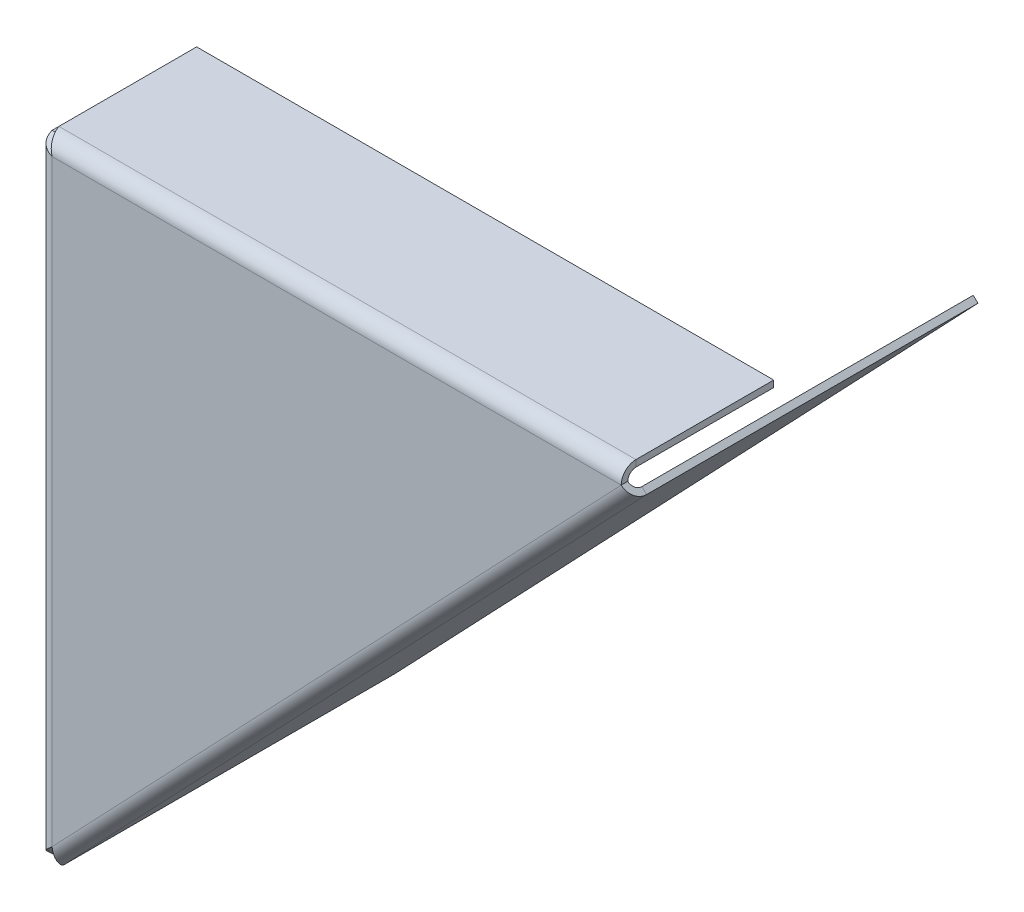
ISO-10303-21;
HEADER;
FILE_DESCRIPTION(('STEP AP214'),'2;1');
FILE_NAME('part.step','',(''),(''),'','','');
FILE_SCHEMA(('AUTOMOTIVE_DESIGN { 1 0 10303 214 1 1 1 1 }'));
ENDSEC;
DATA;
#1=APPLICATION_CONTEXT('core data for automotive mechanical design processes');
#2=APPLICATION_PROTOCOL_DEFINITION('international standard','automotive_design',2000,#1);
#3=PRODUCT_CONTEXT('',#1,'mechanical');
#4=PRODUCT('Part','Part','',(#3));
#5=PRODUCT_RELATED_PRODUCT_CATEGORY('part','',(#4));
#6=PRODUCT_DEFINITION_FORMATION('','',#4);
#7=PRODUCT_DEFINITION_CONTEXT('part definition',#1,'design');
#8=PRODUCT_DEFINITION('design','',#6,#7);
#9=PRODUCT_DEFINITION_SHAPE('','',#8);
#10=(LENGTH_UNIT() NAMED_UNIT(*) SI_UNIT(.MILLI.,.METRE.));
#11=(NAMED_UNIT(*) PLANE_ANGLE_UNIT() SI_UNIT($,.RADIAN.));
#12=(NAMED_UNIT(*) SI_UNIT($,.STERADIAN.) SOLID_ANGLE_UNIT());
#13=UNCERTAINTY_MEASURE_WITH_UNIT(LENGTH_MEASURE(1.E-05),#10,'distance_accuracy_value','');
#14=(GEOMETRIC_REPRESENTATION_CONTEXT(3) GLOBAL_UNCERTAINTY_ASSIGNED_CONTEXT((#13)) GLOBAL_UNIT_ASSIGNED_CONTEXT((#10,
#11,#12)) REPRESENTATION_CONTEXT('',''));
#15=CARTESIAN_POINT('',(0.,0.,0.));
#16=DIRECTION('',(0.,0.,1.));
#17=DIRECTION('',(1.,0.,0.));
#18=AXIS2_PLACEMENT_3D('',#15,#16,#17);
#19=CARTESIAN_POINT('',(0.,0.,1.99999999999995));
#20=DIRECTION('',(0.,0.,1.));
#21=DIRECTION('',(1.,0.,0.));
#22=AXIS2_PLACEMENT_3D('',#19,#20,#21);
#23=PLANE('',#22);
#24=DIRECTION('',(0.,-1.,0.));
#25=VECTOR('',#24,1.);
#26=CARTESIAN_POINT('',(0.,0.,1.99999999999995));
#27=LINE('',#26,#25);
#28=CARTESIAN_POINT('',(0.,0.,1.99999999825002));
#29=VERTEX_POINT('',#28);
#30=CARTESIAN_POINT('',(0.,-182.191293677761,2.00000008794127));
#31=VERTEX_POINT('',#30);
#32=EDGE_CURVE('E223',#29,#31,#27,.T.);
#33=ORIENTED_EDGE('',*,*,#32,.T.);
#34=DIRECTION('',(0.6895592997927,0.724229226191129,0.));
#35=VECTOR('',#34,1.);
#36=CARTESIAN_POINT('',(0.,-182.191293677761,1.99999999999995));
#37=LINE('',#36,#35);
#38=CARTESIAN_POINT('',(173.469526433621,0.,2.00000004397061));
#39=VERTEX_POINT('',#38);
#40=EDGE_CURVE('E487',#31,#39,#37,.T.);
#41=ORIENTED_EDGE('',*,*,#40,.T.);
#42=DIRECTION('',(-1.,0.,0.));
#43=VECTOR('',#42,1.);
#44=CARTESIAN_POINT('',(0.,0.,1.99999999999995));
#45=LINE('',#44,#43);
#46=EDGE_CURVE('E488',#39,#29,#45,.T.);
#47=ORIENTED_EDGE('',*,*,#46,.T.);
#48=EDGE_LOOP('',(#33,#41,#47));
#49=FACE_BOUND('',#48,.T.);
#50=ADVANCED_FACE('F121',(#49),#23,.T.);
#51=CARTESIAN_POINT('',(0.,0.,0.));
#52=DIRECTION('',(0.,0.,1.));
#53=DIRECTION('',(1.,0.,0.));
#54=AXIS2_PLACEMENT_3D('',#51,#52,#53);
#55=PLANE('',#54);
#56=DIRECTION('',(0.,-1.,0.));
#57=VECTOR('',#56,1.);
#58=CARTESIAN_POINT('',(0.,0.,0.));
#59=LINE('',#58,#57);
#60=CARTESIAN_POINT('',(0.,0.,-1.74998253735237E-09));
#61=VERTEX_POINT('',#60);
#62=CARTESIAN_POINT('',(0.,-182.191293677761,8.79412714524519E-08));
#63=VERTEX_POINT('',#62);
#64=EDGE_CURVE('E489',#61,#63,#59,.T.);
#65=ORIENTED_EDGE('',*,*,#64,.F.);
#66=DIRECTION('',(-1.,0.,0.));
#67=VECTOR('',#66,1.);
#68=CARTESIAN_POINT('',(0.,0.,0.));
#69=LINE('',#68,#67);
#70=CARTESIAN_POINT('',(173.469526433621,0.,0.));
#71=VERTEX_POINT('',#70);
#72=EDGE_CURVE('E526',#71,#61,#69,.T.);
#73=ORIENTED_EDGE('',*,*,#72,.F.);
#74=DIRECTION('',(0.6895592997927,0.724229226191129,0.));
#75=VECTOR('',#74,1.);
#76=CARTESIAN_POINT('',(0.,-182.191293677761,0.));
#77=LINE('',#76,#75);
#78=EDGE_CURVE('E130',#63,#71,#77,.T.);
#79=ORIENTED_EDGE('',*,*,#78,.F.);
#80=EDGE_LOOP('',(#65,#73,#79));
#81=FACE_BOUND('',#80,.T.);
#82=ADVANCED_FACE('F123',(#81),#55,.F.);
#83=CARTESIAN_POINT('',(0.,0.,2.01999999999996));
#84=CARTESIAN_POINT('',(-0.202473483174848,0.591762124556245,2.01999999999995));
#85=CARTESIAN_POINT('',(-0.404881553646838,1.18310043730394,1.90235649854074));
#86=CARTESIAN_POINT('',(-0.809763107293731,2.27635779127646,1.4495144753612));
#87=CARTESIAN_POINT('',(-1.01220388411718,2.77775117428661,1.11449412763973));
#88=CARTESIAN_POINT('',(-1.41708543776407,3.61449412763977,0.277751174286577));
#89=CARTESIAN_POINT('',(-1.61952621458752,3.94951447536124,-0.223642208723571));
#90=CARTESIAN_POINT('',(-2.02440776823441,4.40235649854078,-1.31689956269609));
#91=CARTESIAN_POINT('',(-2.2268158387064,4.52,-1.90823787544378));
#92=CARTESIAN_POINT('',(-2.4292893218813,4.52,-2.50000000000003));
#93=CARTESIAN_POINT('',(0.,0.,1.99999999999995));
#94=CARTESIAN_POINT('',(-0.202473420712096,0.589143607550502,1.99999999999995));
#95=CARTESIAN_POINT('',(-0.404881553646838,1.17786547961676,1.88287704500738));
#96=CARTESIAN_POINT('',(-0.809763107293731,2.26628541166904,1.43203874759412));
#97=CARTESIAN_POINT('',(-1.01220388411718,2.76546023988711,1.09850079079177));
#98=CARTESIAN_POINT('',(-1.41708543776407,3.5985007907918,0.265460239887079));
#99=CARTESIAN_POINT('',(-1.61952621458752,3.93203874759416,-0.233714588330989));
#100=CARTESIAN_POINT('',(-2.02440776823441,4.38287704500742,-1.32213452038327));
#101=CARTESIAN_POINT('',(-2.22681590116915,4.5,-1.91085639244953));
#102=CARTESIAN_POINT('',(-2.4292893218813,4.5,-2.50000000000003));
#103=CARTESIAN_POINT('',(0.,0.,0.));
#104=CARTESIAN_POINT('',(-0.202467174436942,0.327291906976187,0.));
#105=CARTESIAN_POINT('',(-0.404881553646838,0.654369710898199,-0.0650683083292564));
#106=CARTESIAN_POINT('',(-0.809763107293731,1.25904745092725,-0.315534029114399));
#107=CARTESIAN_POINT('',(-1.01220388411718,1.53636679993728,-0.500832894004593));
#108=CARTESIAN_POINT('',(-1.41708543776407,1.99916710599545,-0.963633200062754));
#109=CARTESIAN_POINT('',(-1.61952621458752,2.18446597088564,-1.24095254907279));
#110=CARTESIAN_POINT('',(-2.02440776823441,2.43493169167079,-1.84563028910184));
#111=CARTESIAN_POINT('',(-2.22682214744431,2.5,-2.17270809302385));
#112=CARTESIAN_POINT('',(-2.4292893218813,2.5,-2.50000000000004));
#113=CARTESIAN_POINT('',(0.,0.,-0.0202000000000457));
#114=CARTESIAN_POINT('',(-0.202467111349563,0.324647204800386,-0.0202000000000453));
#115=CARTESIAN_POINT('',(-0.404881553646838,0.649082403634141,-0.084742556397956));
#116=CARTESIAN_POINT('',(-0.809763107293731,1.24887434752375,-0.333184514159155));
#117=CARTESIAN_POINT('',(-1.01220388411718,1.52395295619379,-0.516986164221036));
#118=CARTESIAN_POINT('',(-1.41708543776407,1.983013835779,-0.976047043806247));
#119=CARTESIAN_POINT('',(-1.61952621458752,2.16681548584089,-1.25112565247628));
#120=CARTESIAN_POINT('',(-2.02440776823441,2.41525744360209,-1.8509175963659));
#121=CARTESIAN_POINT('',(-2.22682221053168,2.4798,-2.17535279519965));
#122=CARTESIAN_POINT('',(-2.4292893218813,2.4798,-2.50000000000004));
#123=B_SPLINE_SURFACE_WITH_KNOTS('',1,3,((#83,#84,#85,#86,#87,#88,#89,#90,#91,#92),(#93,#94,#95,
#96,#97,#98,#99,#100,#101,#102),(#103,#104,#105,#106,#107,#108,#109,#110,#111,#112),(#113,#114,
#115,#116,#117,#118,#119,#120,#121,#122)),.UNSPECIFIED.,.F.,.F.,.F.,(2,1,1,2),(4,2,2,2,4),
(-0.01,0.,1.,1.0101),(0.,0.25,0.5,0.75,1.),.UNSPECIFIED.);
#124=DIRECTION('',(0.,-1.,0.));
#125=VECTOR('',#124,1.);
#126=CARTESIAN_POINT('',(-2.42928932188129,4.5,-2.50000000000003));
#127=LINE('',#126,#125);
#128=CARTESIAN_POINT('',(-2.4292893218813,2.5,-2.50000000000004));
#129=VERTEX_POINT('',#128);
#130=CARTESIAN_POINT('',(-2.4292893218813,4.5,-2.50000000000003));
#131=VERTEX_POINT('',#130);
#132=EDGE_CURVE('E158',#129,#131,#127,.F.);
#133=CARTESIAN_POINT('',(0.,0.,0.));
#134=CARTESIAN_POINT('',(-0.0453245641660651,0.0732648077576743,8.72828186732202E-06));
#135=CARTESIAN_POINT('',(-0.0906481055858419,0.146528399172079,-0.00322033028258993));
#136=CARTESIAN_POINT('',(-0.181287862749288,0.292481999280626,-0.0160899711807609));
#137=CARTESIAN_POINT('',(-0.22660407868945,0.365172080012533,-0.0257297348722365));
#138=CARTESIAN_POINT('',(-0.317254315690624,0.509456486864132,-0.0513620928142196));
#139=CARTESIAN_POINT('',(-0.362588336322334,0.581050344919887,-0.0673573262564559));
#140=CARTESIAN_POINT('',(-0.453261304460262,0.722557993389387,-0.105572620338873));
#141=CARTESIAN_POINT('',(-0.498600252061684,0.792471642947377,-0.127793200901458));
#142=CARTESIAN_POINT('',(-0.595116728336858,0.938935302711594,-0.181543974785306));
#143=CARTESIAN_POINT('',(-0.64629530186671,1.01518255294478,-0.213903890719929));
#144=CARTESIAN_POINT('',(-0.748657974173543,1.16410927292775,-0.286019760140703));
#145=CARTESIAN_POINT('',(-0.799842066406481,1.23678724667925,-0.325778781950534));
#146=CARTESIAN_POINT('',(-0.953316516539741,1.44824985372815,-0.455532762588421));
#147=CARTESIAN_POINT('',(-1.055677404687,1.58069258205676,-0.556089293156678));
#148=CARTESIAN_POINT('',(-1.26042206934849,1.82312463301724,-0.781394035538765));
#149=CARTESIAN_POINT('',(-1.36280584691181,1.93311037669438,-0.906146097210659));
#150=CARTESIAN_POINT('',(-1.51631405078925,2.07800929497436,-1.10760577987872));
#151=CARTESIAN_POINT('',(-1.56751447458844,2.12299115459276,-1.17721104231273));
#152=CARTESIAN_POINT('',(-1.66991342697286,2.20582859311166,-1.32052606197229));
#153=CARTESIAN_POINT('',(-1.72111194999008,2.24368665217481,-1.39423437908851));
#154=CARTESIAN_POINT('',(-1.82701863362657,2.31424378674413,-1.55021154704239));
#155=CARTESIAN_POINT('',(-1.88172681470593,2.34641137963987,-1.63272086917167));
#156=CARTESIAN_POINT('',(-1.9911458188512,2.40183057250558,-1.80069100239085));
#157=CARTESIAN_POINT('',(-2.04585664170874,2.42508136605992,-1.88615207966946));
#158=CARTESIAN_POINT('',(-2.15535214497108,2.46241975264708,-2.0591760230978));
#159=CARTESIAN_POINT('',(-2.21013682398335,2.47649476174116,-2.1467416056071));
#160=CARTESIAN_POINT('',(-2.31970982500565,2.49529456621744,-2.32287091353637));
#161=CARTESIAN_POINT('',(-2.37449814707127,2.50001913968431,-2.41143466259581));
#162=CARTESIAN_POINT('',(-2.4292893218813,2.5,-2.50000000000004));
#163=B_SPLINE_CURVE_WITH_KNOTS('',3,(#133,#134,#135,#136,#137,#138,#139,#140,#141,#142,#143,
#144,#145,#146,#147,#148,#149,#150,#151,#152,#153,#154,#155,#156,#157,#158,#159,#160,#161,#162),
.UNSPECIFIED.,.F.,.F.,(4,2,2,2,2,2,2,2,2,2,2,2,2,2,4),(0.,0.258390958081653,0.516748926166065,
0.775214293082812,1.03370125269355,1.32542887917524,1.61727775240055,2.20012840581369,
2.78307187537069,3.07502634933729,3.36687899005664,3.67873630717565,3.99062182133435,
4.30293416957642,4.61525392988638),.UNSPECIFIED.);
#164=EDGE_CURVE('E483',#61,#129,#163,.T.);
#165=CARTESIAN_POINT('',(0.,0.,1.99999999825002));
#166=CARTESIAN_POINT('',(0.,0.,-1.74998253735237E-09));
#167=B_SPLINE_CURVE_WITH_KNOTS('',1,(#165,#166),.UNSPECIFIED.,.F.,.F.,(2,2),(0.,1.),.UNSPECIFIED.);
#168=EDGE_CURVE('E491',#29,#61,#167,.T.);
#169=CARTESIAN_POINT('',(0.,0.,1.99999999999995));
#170=CARTESIAN_POINT('',(-0.0460035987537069,0.133852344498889,2.0000170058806));
#171=CARTESIAN_POINT('',(-0.0920061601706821,0.267702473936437,1.99402856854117));
#172=CARTESIAN_POINT('',(-0.184006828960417,0.534332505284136,1.97016352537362));
#173=CARTESIAN_POINT('',(-0.230004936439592,0.667112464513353,1.9522875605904));
#174=CARTESIAN_POINT('',(-0.321962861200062,0.930446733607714,1.9047889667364));
#175=CARTESIAN_POINT('',(-0.367922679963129,1.0610027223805,1.8751756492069));
#176=CARTESIAN_POINT('',(-0.459845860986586,1.31895643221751,1.80444383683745));
#177=CARTESIAN_POINT('',(-0.505809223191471,1.44635419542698,1.76332549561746));
#178=CARTESIAN_POINT('',(-0.59776379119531,1.69706000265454,1.66987954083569));
#179=CARTESIAN_POINT('',(-0.643754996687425,1.82036547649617,1.61754503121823));
#180=CARTESIAN_POINT('',(-0.735754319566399,2.06186789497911,1.50207713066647));
#181=CARTESIAN_POINT('',(-0.781762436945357,2.18006294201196,1.43893977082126));
#182=CARTESIAN_POINT('',(-0.873746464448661,2.41028578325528,1.30242306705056));
#183=CARTESIAN_POINT('',(-0.919722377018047,2.52231731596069,1.22905002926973));
#184=CARTESIAN_POINT('',(-1.01169322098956,2.7394364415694,1.07259001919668));
#185=CARTESIAN_POINT('',(-1.05768815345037,2.84452160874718,0.989499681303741));
#186=CARTESIAN_POINT('',(-1.14966782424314,3.04684511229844,0.814307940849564));
#187=CARTESIAN_POINT('',(-1.19565256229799,3.14408537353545,0.722208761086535));
#188=CARTESIAN_POINT('',(-1.28762275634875,3.32997485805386,0.52971447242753));
#189=CARTESIAN_POINT('',(-1.33360821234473,3.41862408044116,0.429319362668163));
#190=CARTESIAN_POINT('',(-1.42560187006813,3.58667601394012,0.220970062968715));
#191=CARTESIAN_POINT('',(-1.47161006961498,3.66607336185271,0.113011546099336));
#192=CARTESIAN_POINT('',(-1.56361041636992,3.81490337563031,-0.109514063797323));
#193=CARTESIAN_POINT('',(-1.60960256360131,3.88433949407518,-0.224078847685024));
#194=CARTESIAN_POINT('',(-1.7016276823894,4.01277864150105,-0.459032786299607));
#195=CARTESIAN_POINT('',(-1.7476606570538,4.07177324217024,-0.579426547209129));
#196=CARTESIAN_POINT('',(-1.83970886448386,4.17877180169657,-0.824950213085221));
#197=CARTESIAN_POINT('',(-1.885724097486,4.22677983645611,-0.950078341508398));
#198=CARTESIAN_POINT('',(-1.97771164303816,4.31141286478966,-1.20400082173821));
#199=CARTESIAN_POINT('',(-2.02368395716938,4.34804800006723,-1.33279179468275));
#200=CARTESIAN_POINT('',(-2.11560853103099,4.40969031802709,-1.59307716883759));
#201=CARTESIAN_POINT('',(-2.16156079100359,4.43470242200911,-1.72457040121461));
#202=CARTESIAN_POINT('',(-2.24450645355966,4.46919477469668,-1.96344889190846));
#203=CARTESIAN_POINT('',(-2.28150074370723,4.48075184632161,-2.07053895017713));
#204=CARTESIAN_POINT('',(-2.3554256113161,4.49615061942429,-2.28508374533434));
#205=CARTESIAN_POINT('',(-2.39235618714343,4.50000576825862,-2.39253751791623));
#206=CARTESIAN_POINT('',(-2.4292893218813,4.5,-2.50000000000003));
#207=B_SPLINE_CURVE_WITH_KNOTS('',3,(#169,#170,#171,#172,#173,#174,#175,#176,#177,#178,#179,
#180,#181,#182,#183,#184,#185,#186,#187,#188,#189,#190,#191,#192,#193,#194,#195,#196,#197,#198,
#199,#200,#201,#202,#203,#204,#205,#206),.UNSPECIFIED.,.F.,.F.,(4,2,2,2,2,2,2,2,2,2,2,2,2,2,2,2,
2,2,4),(0.,0.424481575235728,0.84894026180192,1.27306288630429,1.69717984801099,
2.12155832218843,2.54609304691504,2.97036736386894,3.39478906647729,3.81910631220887,
4.24342360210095,4.66798565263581,5.09240019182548,5.51715576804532,5.94175350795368,
6.36597152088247,6.79000975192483,7.13141947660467,7.47223258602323),.UNSPECIFIED.);
#208=EDGE_CURVE('E482',#29,#131,#207,.T.);
#209=ORIENTED_EDGE('',*,*,#132,.F.);
#210=ORIENTED_EDGE('',*,*,#164,.F.);
#211=ORIENTED_EDGE('',*,*,#168,.F.);
#212=ORIENTED_EDGE('',*,*,#208,.T.);
#213=EDGE_LOOP('',(#209,#210,#211,#212));
#214=FACE_BOUND('',#213,.T.);
#215=ADVANCED_FACE('F535',(#214),#123,.F.);
#216=CARTESIAN_POINT('',(173.469526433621,0.,-2.50000000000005));
#217=DIRECTION('',(-1.,0.,0.));
#218=DIRECTION('',(0.,0.,1.));
#219=AXIS2_PLACEMENT_3D('',#216,#217,#218);
#220=PLANE('',#219);
#221=CARTESIAN_POINT('',(173.469526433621,0.,-2.50000000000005));
#222=DIRECTION('',(1.,0.,0.));
#223=DIRECTION('',(0.,0.,-1.));
#224=AXIS2_PLACEMENT_3D('',#221,#222,#223);
#225=CIRCLE('',#224,2.5);
#226=CARTESIAN_POINT('',(173.469526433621,2.5,-2.50000000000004));
#227=VERTEX_POINT('',#226);
#228=EDGE_CURVE('E477',#227,#71,#225,.T.);
#229=ORIENTED_EDGE('',*,*,#228,.F.);
#230=DIRECTION('',(0.,-1.,0.));
#231=VECTOR('',#230,1.);
#232=CARTESIAN_POINT('',(173.469526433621,2.5,-2.50000000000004));
#233=LINE('',#232,#231);
#234=CARTESIAN_POINT('',(173.469526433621,4.5,-2.50000000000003));
#235=VERTEX_POINT('',#234);
#236=EDGE_CURVE('E481',#227,#235,#233,.F.);
#237=ORIENTED_EDGE('',*,*,#236,.T.);
#238=CARTESIAN_POINT('',(173.469526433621,0.,-2.50000000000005));
#239=DIRECTION('',(1.,0.,0.));
#240=DIRECTION('',(0.,0.,-1.));
#241=AXIS2_PLACEMENT_3D('',#238,#239,#240);
#242=CIRCLE('',#241,4.5);
#243=EDGE_CURVE('E479',#235,#39,#242,.T.);
#244=ORIENTED_EDGE('',*,*,#243,.T.);
#245=DIRECTION('',(0.,0.,-1.));
#246=VECTOR('',#245,1.);
#247=CARTESIAN_POINT('',(173.469526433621,0.,1.99999999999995));
#248=LINE('',#247,#246);
#249=EDGE_CURVE('E13',#39,#71,#248,.T.);
#250=ORIENTED_EDGE('',*,*,#249,.T.);
#251=EDGE_LOOP('',(#229,#237,#244,#250));
#252=FACE_BOUND('',#251,.T.);
#253=ADVANCED_FACE('F474',(#252),#220,.F.);
#254=CARTESIAN_POINT('',(173.469526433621,0.,-2.50000000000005));
#255=DIRECTION('',(1.,0.,0.));
#256=DIRECTION('',(0.,1.,0.));
#257=AXIS2_PLACEMENT_3D('',#254,#255,#256);
#258=CYLINDRICAL_SURFACE('',#257,4.5);
#259=ORIENTED_EDGE('',*,*,#46,.F.);
#260=ORIENTED_EDGE('',*,*,#243,.F.);
#261=DIRECTION('',(1.,0.,0.));
#262=VECTOR('',#261,1.);
#263=CARTESIAN_POINT('',(0.,4.5,-2.50000000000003));
#264=LINE('',#263,#262);
#265=EDGE_CURVE('E147',#235,#131,#264,.F.);
#266=ORIENTED_EDGE('',*,*,#265,.T.);
#267=ORIENTED_EDGE('',*,*,#208,.F.);
#268=EDGE_LOOP('',(#259,#260,#266,#267));
#269=FACE_BOUND('',#268,.T.);
#270=ADVANCED_FACE('F539',(#269),#258,.T.);
#271=CARTESIAN_POINT('',(173.469526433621,0.,-2.50000000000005));
#272=DIRECTION('',(1.,0.,0.));
#273=DIRECTION('',(0.,1.,0.));
#274=AXIS2_PLACEMENT_3D('',#271,#272,#273);
#275=CYLINDRICAL_SURFACE('',#274,2.5);
#276=ORIENTED_EDGE('',*,*,#72,.T.);
#277=ORIENTED_EDGE('',*,*,#164,.T.);
#278=DIRECTION('',(1.,0.,0.));
#279=VECTOR('',#278,1.);
#280=CARTESIAN_POINT('',(0.,2.5,-2.50000000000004));
#281=LINE('',#280,#279);
#282=EDGE_CURVE('E596',#129,#227,#281,.T.);
#283=ORIENTED_EDGE('',*,*,#282,.T.);
#284=ORIENTED_EDGE('',*,*,#228,.T.);
#285=EDGE_LOOP('',(#276,#277,#283,#284));
#286=FACE_BOUND('',#285,.T.);
#287=ADVANCED_FACE('F540',(#286),#275,.F.);
#288=CARTESIAN_POINT('',(173.469526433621,4.50000000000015,-44.4862846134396));
#289=DIRECTION('',(-1.,0.,0.));
#290=DIRECTION('',(0.,0.,1.));
#291=AXIS2_PLACEMENT_3D('',#288,#289,#290);
#292=PLANE('',#291);
#293=ORIENTED_EDGE('',*,*,#236,.F.);
#294=DIRECTION('',(0.,0.,1.));
#295=VECTOR('',#294,1.);
#296=CARTESIAN_POINT('',(173.469526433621,2.50000000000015,-44.4862846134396));
#297=LINE('',#296,#295);
#298=CARTESIAN_POINT('',(173.469526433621,2.50000000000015,-44.4862846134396));
#299=VERTEX_POINT('',#298);
#300=EDGE_CURVE('E600',#227,#299,#297,.F.);
#301=ORIENTED_EDGE('',*,*,#300,.T.);
#302=DIRECTION('',(0.,-1.,0.));
#303=VECTOR('',#302,1.);
#304=CARTESIAN_POINT('',(173.469526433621,4.50000000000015,-44.4862846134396));
#305=LINE('',#304,#303);
#306=CARTESIAN_POINT('',(173.469526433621,4.50000000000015,-44.4862846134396));
#307=VERTEX_POINT('',#306);
#308=EDGE_CURVE('E606',#307,#299,#305,.T.);
#309=ORIENTED_EDGE('',*,*,#308,.F.);
#310=DIRECTION('',(0.,0.,-1.));
#311=VECTOR('',#310,1.);
#312=CARTESIAN_POINT('',(173.469526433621,4.49999999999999,0.));
#313=LINE('',#312,#311);
#314=EDGE_CURVE('E166',#235,#307,#313,.T.);
#315=ORIENTED_EDGE('',*,*,#314,.F.);
#316=EDGE_LOOP('',(#293,#301,#309,#315));
#317=FACE_BOUND('',#316,.T.);
#318=ADVANCED_FACE('F636',(#317),#292,.F.);
#319=CARTESIAN_POINT('',(173.469526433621,4.49999999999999,0.));
#320=DIRECTION('',(0.,-1.,0.));
#321=DIRECTION('',(0.,0.,-1.));
#322=AXIS2_PLACEMENT_3D('',#319,#320,#321);
#323=PLANE('',#322);
#324=ORIENTED_EDGE('',*,*,#265,.F.);
#325=ORIENTED_EDGE('',*,*,#314,.T.);
#326=DIRECTION('',(-1.,0.,0.));
#327=VECTOR('',#326,1.);
#328=CARTESIAN_POINT('',(173.469526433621,4.50000000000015,-44.4862846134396));
#329=LINE('',#328,#327);
#330=CARTESIAN_POINT('',(-2.42928932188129,4.50000000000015,-44.4862846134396));
#331=VERTEX_POINT('',#330);
#332=EDGE_CURVE('E181',#307,#331,#329,.T.);
#333=ORIENTED_EDGE('',*,*,#332,.T.);
#334=DIRECTION('',(0.,0.,1.));
#335=VECTOR('',#334,1.);
#336=CARTESIAN_POINT('',(-2.42928932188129,4.49999999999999,0.));
#337=LINE('',#336,#335);
#338=EDGE_CURVE('E584',#331,#131,#337,.T.);
#339=ORIENTED_EDGE('',*,*,#338,.T.);
#340=EDGE_LOOP('',(#324,#325,#333,#339));
#341=FACE_BOUND('',#340,.T.);
#342=ADVANCED_FACE('F590',(#341),#323,.F.);
#343=CARTESIAN_POINT('',(173.469526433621,2.49999999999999,0.));
#344=DIRECTION('',(0.,-1.,0.));
#345=DIRECTION('',(0.,0.,-1.));
#346=AXIS2_PLACEMENT_3D('',#343,#344,#345);
#347=PLANE('',#346);
#348=ORIENTED_EDGE('',*,*,#300,.F.);
#349=ORIENTED_EDGE('',*,*,#282,.F.);
#350=DIRECTION('',(0.,0.,-1.));
#351=VECTOR('',#350,1.);
#352=CARTESIAN_POINT('',(-2.42928932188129,2.49999999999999,0.));
#353=LINE('',#352,#351);
#354=CARTESIAN_POINT('',(-2.42928932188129,2.50000000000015,-44.4862846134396));
#355=VERTEX_POINT('',#354);
#356=EDGE_CURVE('E587',#355,#129,#353,.F.);
#357=ORIENTED_EDGE('',*,*,#356,.F.);
#358=DIRECTION('',(1.,0.,0.));
#359=VECTOR('',#358,1.);
#360=CARTESIAN_POINT('',(0.,2.50000000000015,-44.4862846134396));
#361=LINE('',#360,#359);
#362=EDGE_CURVE('E602',#299,#355,#361,.F.);
#363=ORIENTED_EDGE('',*,*,#362,.F.);
#364=EDGE_LOOP('',(#348,#349,#357,#363));
#365=FACE_BOUND('',#364,.T.);
#366=ADVANCED_FACE('F635',(#365),#347,.T.);
#367=CARTESIAN_POINT('',(0.,4.50000000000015,-44.4862846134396));
#368=DIRECTION('',(0.,0.,1.));
#369=DIRECTION('',(0.,-1.,0.));
#370=AXIS2_PLACEMENT_3D('',#367,#368,#369);
#371=PLANE('',#370);
#372=ORIENTED_EDGE('',*,*,#362,.T.);
#373=DIRECTION('',(0.,-1.,0.));
#374=VECTOR('',#373,1.);
#375=CARTESIAN_POINT('',(-2.42928932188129,4.50000000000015,-44.4862846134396));
#376=LINE('',#375,#374);
#377=EDGE_CURVE('E591',#331,#355,#376,.T.);
#378=ORIENTED_EDGE('',*,*,#377,.F.);
#379=ORIENTED_EDGE('',*,*,#332,.F.);
#380=ORIENTED_EDGE('',*,*,#308,.T.);
#381=EDGE_LOOP('',(#372,#378,#379,#380));
#382=FACE_BOUND('',#381,.T.);
#383=ADVANCED_FACE('F632',(#382),#371,.F.);
#384=CARTESIAN_POINT('',(-2.42928932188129,4.49999999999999,0.));
#385=DIRECTION('',(1.,0.,0.));
#386=DIRECTION('',(0.,0.,-1.));
#387=AXIS2_PLACEMENT_3D('',#384,#385,#386);
#388=PLANE('',#387);
#389=ORIENTED_EDGE('',*,*,#132,.T.);
#390=ORIENTED_EDGE('',*,*,#338,.F.);
#391=ORIENTED_EDGE('',*,*,#377,.T.);
#392=ORIENTED_EDGE('',*,*,#356,.T.);
#393=EDGE_LOOP('',(#389,#390,#391,#392));
#394=FACE_BOUND('',#393,.T.);
#395=ADVANCED_FACE('F582',(#394),#388,.F.);
#396=CARTESIAN_POINT('',(-4.50000000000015,-182.191293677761,-44.4862846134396));
#397=DIRECTION('',(0.,0.,1.));
#398=DIRECTION('',(1.,0.,0.));
#399=AXIS2_PLACEMENT_3D('',#396,#397,#398);
#400=PLANE('',#399);
#401=DIRECTION('',(0.,1.,0.));
#402=VECTOR('',#401,1.);
#403=CARTESIAN_POINT('',(-2.50000000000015,-182.191293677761,-44.4862846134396));
#404=LINE('',#403,#402);
#405=CARTESIAN_POINT('',(-2.50000000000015,2.42928932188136,-44.4862846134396));
#406=VERTEX_POINT('',#405);
#407=CARTESIAN_POINT('',(-2.50000000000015,-188.442493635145,-44.4862846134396));
#408=VERTEX_POINT('',#407);
#409=EDGE_CURVE('E190',#406,#408,#404,.F.);
#410=ORIENTED_EDGE('',*,*,#409,.T.);
#411=DIRECTION('',(1.,0.,0.));
#412=VECTOR('',#411,1.);
#413=CARTESIAN_POINT('',(-4.50000000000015,-188.442493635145,-44.4862846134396));
#414=LINE('',#413,#412);
#415=CARTESIAN_POINT('',(-4.50000000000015,-188.442493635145,-44.4862846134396));
#416=VERTEX_POINT('',#415);
#417=EDGE_CURVE('E588',#416,#408,#414,.T.);
#418=ORIENTED_EDGE('',*,*,#417,.F.);
#419=DIRECTION('',(0.,-1.,0.));
#420=VECTOR('',#419,1.);
#421=CARTESIAN_POINT('',(-4.50000000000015,0.,-44.4862846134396));
#422=LINE('',#421,#420);
#423=CARTESIAN_POINT('',(-4.50000000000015,2.42928932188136,-44.4862846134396));
#424=VERTEX_POINT('',#423);
#425=EDGE_CURVE('E726',#424,#416,#422,.T.);
#426=ORIENTED_EDGE('',*,*,#425,.F.);
#427=DIRECTION('',(1.,0.,0.));
#428=VECTOR('',#427,1.);
#429=CARTESIAN_POINT('',(-4.50000000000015,2.42928932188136,-44.4862846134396));
#430=LINE('',#429,#428);
#431=EDGE_CURVE('E714',#424,#406,#430,.T.);
#432=ORIENTED_EDGE('',*,*,#431,.T.);
#433=EDGE_LOOP('',(#410,#418,#426,#432));
#434=FACE_BOUND('',#433,.T.);
#435=ADVANCED_FACE('F631',(#434),#400,.F.);
#436=CARTESIAN_POINT('',(-4.49999999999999,0.,0.));
#437=DIRECTION('',(1.,0.,0.));
#438=DIRECTION('',(0.,0.,-1.));
#439=AXIS2_PLACEMENT_3D('',#436,#437,#438);
#440=PLANE('',#439);
#441=DIRECTION('',(0.,-1.,0.));
#442=VECTOR('',#441,1.);
#443=CARTESIAN_POINT('',(-4.5,-182.191293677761,-2.49999999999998));
#444=LINE('',#443,#442);
#445=CARTESIAN_POINT('',(-4.49999999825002,2.42928932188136,-2.49999999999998));
#446=VERTEX_POINT('',#445);
#447=CARTESIAN_POINT('',(-4.5,-188.442493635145,-2.49999999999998));
#448=VERTEX_POINT('',#447);
#449=EDGE_CURVE('E510',#446,#448,#444,.T.);
#450=ORIENTED_EDGE('',*,*,#449,.F.);
#451=DIRECTION('',(0.,0.,-1.));
#452=VECTOR('',#451,1.);
#453=CARTESIAN_POINT('',(-4.49999999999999,2.42928932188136,0.));
#454=LINE('',#453,#452);
#455=EDGE_CURVE('E730',#446,#424,#454,.T.);
#456=ORIENTED_EDGE('',*,*,#455,.T.);
#457=ORIENTED_EDGE('',*,*,#425,.T.);
#458=DIRECTION('',(0.,0.,-1.));
#459=VECTOR('',#458,1.);
#460=CARTESIAN_POINT('',(-4.5,-188.442493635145,-2.49999999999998));
#461=LINE('',#460,#459);
#462=EDGE_CURVE('E216',#448,#416,#461,.T.);
#463=ORIENTED_EDGE('',*,*,#462,.F.);
#464=EDGE_LOOP('',(#450,#456,#457,#463));
#465=FACE_BOUND('',#464,.T.);
#466=ADVANCED_FACE('F742',(#465),#440,.F.);
#467=CARTESIAN_POINT('',(-4.50000000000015,2.42928932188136,-44.4862846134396));
#468=DIRECTION('',(0.,-1.,0.));
#469=DIRECTION('',(0.,0.,-1.));
#470=AXIS2_PLACEMENT_3D('',#467,#468,#469);
#471=PLANE('',#470);
#472=CARTESIAN_POINT('',(-2.49999999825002,2.42928932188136,-2.49999999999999));
#473=CARTESIAN_POINT('',(-4.49999999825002,2.42928932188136,-2.49999999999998));
#474=B_SPLINE_CURVE_WITH_KNOTS('',1,(#472,#473),.UNSPECIFIED.,.F.,.F.,(2,2),(0.,1.),.UNSPECIFIED.);
#475=CARTESIAN_POINT('',(-2.5,2.42928932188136,-2.49999999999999));
#476=VERTEX_POINT('',#475);
#477=EDGE_CURVE('E710',#476,#446,#474,.T.);
#478=ORIENTED_EDGE('',*,*,#477,.F.);
#479=DIRECTION('',(0.,0.,1.));
#480=VECTOR('',#479,1.);
#481=CARTESIAN_POINT('',(-2.50000000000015,2.42928932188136,-44.4862846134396));
#482=LINE('',#481,#480);
#483=EDGE_CURVE('E724',#476,#406,#482,.F.);
#484=ORIENTED_EDGE('',*,*,#483,.T.);
#485=ORIENTED_EDGE('',*,*,#431,.F.);
#486=ORIENTED_EDGE('',*,*,#455,.F.);
#487=EDGE_LOOP('',(#478,#484,#485,#486));
#488=FACE_BOUND('',#487,.T.);
#489=ADVANCED_FACE('F741',(#488),#471,.F.);
#490=CARTESIAN_POINT('',(-2.49999999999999,0.,0.));
#491=DIRECTION('',(1.,0.,0.));
#492=DIRECTION('',(0.,0.,-1.));
#493=AXIS2_PLACEMENT_3D('',#490,#491,#492);
#494=PLANE('',#493);
#495=ORIENTED_EDGE('',*,*,#409,.F.);
#496=ORIENTED_EDGE('',*,*,#483,.F.);
#497=DIRECTION('',(0.,1.,0.));
#498=VECTOR('',#497,1.);
#499=CARTESIAN_POINT('',(-2.5,-182.191293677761,-2.49999999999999));
#500=LINE('',#499,#498);
#501=CARTESIAN_POINT('',(-2.5,-188.442493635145,-2.49999999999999));
#502=VERTEX_POINT('',#501);
#503=EDGE_CURVE('E713',#502,#476,#500,.T.);
#504=ORIENTED_EDGE('',*,*,#503,.F.);
#505=DIRECTION('',(0.,0.,-1.));
#506=VECTOR('',#505,1.);
#507=CARTESIAN_POINT('',(-2.5,-188.442493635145,-2.49999999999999));
#508=LINE('',#507,#506);
#509=EDGE_CURVE('E209',#502,#408,#508,.T.);
#510=ORIENTED_EDGE('',*,*,#509,.T.);
#511=EDGE_LOOP('',(#495,#496,#504,#510));
#512=FACE_BOUND('',#511,.T.);
#513=ADVANCED_FACE('F627',(#512),#494,.T.);
#514=CARTESIAN_POINT('',(-4.5,-188.442493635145,-2.49999999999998));
#515=DIRECTION('',(0.,-1.,0.));
#516=DIRECTION('',(0.,0.,-1.));
#517=AXIS2_PLACEMENT_3D('',#514,#515,#516);
#518=PLANE('',#517);
#519=ORIENTED_EDGE('',*,*,#509,.F.);
#520=CARTESIAN_POINT('',(-4.51999999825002,-188.442493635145,-2.49999999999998));
#521=CARTESIAN_POINT('',(-4.49999999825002,-188.442493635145,-2.49999999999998));
#522=CARTESIAN_POINT('',(-2.49999999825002,-188.442493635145,-2.49999999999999));
#523=CARTESIAN_POINT('',(-2.47979999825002,-188.442493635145,-2.49999999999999));
#524=B_SPLINE_CURVE_WITH_KNOTS('',1,(#520,#521,#522,#523),.UNSPECIFIED.,.F.,.F.,(2,1,1,2),
(-0.01,0.,1.,1.0101),.UNSPECIFIED.);
#525=EDGE_CURVE('E519',#448,#502,#524,.T.);
#526=ORIENTED_EDGE('',*,*,#525,.F.);
#527=ORIENTED_EDGE('',*,*,#462,.T.);
#528=ORIENTED_EDGE('',*,*,#417,.T.);
#529=EDGE_LOOP('',(#519,#526,#527,#528));
#530=FACE_BOUND('',#529,.T.);
#531=ADVANCED_FACE('F617',(#530),#518,.T.);
#532=CARTESIAN_POINT('',(-4.51999999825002,-188.442493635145,-2.49999999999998));
#533=CARTESIAN_POINT('',(-4.51999999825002,-187.921507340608,-1.90827336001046));
#534=CARTESIAN_POINT('',(-4.40235649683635,-187.400626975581,-1.3168995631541));
#535=CARTESIAN_POINT('',(-3.94951447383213,-186.358760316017,-0.223642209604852));
#536=CARTESIAN_POINT('',(-3.61449412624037,-185.837826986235,0.277751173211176));
#537=CARTESIAN_POINT('',(-2.77775117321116,-184.795960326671,1.11449412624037));
#538=CARTESIAN_POINT('',(-2.27635779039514,-184.275026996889,1.44951447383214));
#539=CARTESIAN_POINT('',(-1.18310043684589,-183.233160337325,1.90235649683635));
#540=CARTESIAN_POINT('',(-0.591726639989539,-182.712279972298,2.01999999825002));
#541=CARTESIAN_POINT('',(0.,-182.191293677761,2.01999999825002));
#542=CARTESIAN_POINT('',(-4.49999999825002,-188.442493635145,-2.49999999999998));
#543=CARTESIAN_POINT('',(-4.49999999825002,-187.921507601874,-1.91089178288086));
#544=CARTESIAN_POINT('',(-4.38287704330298,-187.400626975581,-1.32213452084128));
#545=CARTESIAN_POINT('',(-3.93203874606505,-186.358760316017,-0.23371458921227));
#546=CARTESIAN_POINT('',(-3.5985007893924,-185.837826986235,0.265460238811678));
#547=CARTESIAN_POINT('',(-2.76546023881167,-184.795960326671,1.09850078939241));
#548=CARTESIAN_POINT('',(-2.26628541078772,-184.275026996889,1.43203874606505));
#549=CARTESIAN_POINT('',(-1.1778654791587,-183.233160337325,1.88287704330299));
#550=CARTESIAN_POINT('',(-0.589108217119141,-182.712279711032,1.99999999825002));
#551=CARTESIAN_POINT('',(0.,-182.191293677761,1.99999999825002));
#552=CARTESIAN_POINT('',(-2.49999999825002,-188.442493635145,-2.49999999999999));
#553=CARTESIAN_POINT('',(-2.49999999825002,-187.921533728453,-2.17273406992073));
#554=CARTESIAN_POINT('',(-2.43493168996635,-187.400626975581,-1.84563028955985));
#555=CARTESIAN_POINT('',(-2.18446596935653,-186.358760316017,-1.24095254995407));
#556=CARTESIAN_POINT('',(-1.99916710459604,-185.837826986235,-0.963633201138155));
#557=CARTESIAN_POINT('',(-1.53636679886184,-184.795960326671,-0.500832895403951));
#558=CARTESIAN_POINT('',(-1.25904745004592,-184.275026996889,-0.315534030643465));
#559=CARTESIAN_POINT('',(-0.654369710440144,-183.233160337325,-0.0650683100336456));
#560=CARTESIAN_POINT('',(-0.327265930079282,-182.712253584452,-1.74998261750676E-09));
#561=CARTESIAN_POINT('',(0.,-182.191293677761,-1.74998253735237E-09));
#562=CARTESIAN_POINT('',(-2.47979999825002,-188.442493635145,-2.49999999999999));
#563=CARTESIAN_POINT('',(-2.47979999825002,-187.921533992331,-2.17537867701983));
#564=CARTESIAN_POINT('',(-2.41525744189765,-187.400626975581,-1.85091759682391));
#565=CARTESIAN_POINT('',(-2.16681548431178,-186.358760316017,-1.25112565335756));
#566=CARTESIAN_POINT('',(-1.9830138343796,-185.837826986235,-0.976047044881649));
#567=CARTESIAN_POINT('',(-1.52395295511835,-184.795960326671,-0.516986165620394));
#568=CARTESIAN_POINT('',(-1.24887434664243,-184.275026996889,-0.33318451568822));
#569=CARTESIAN_POINT('',(-0.649082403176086,-183.233160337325,-0.0847425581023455));
#570=CARTESIAN_POINT('',(-0.324621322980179,-182.712253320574,-0.0202000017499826));
#571=CARTESIAN_POINT('',(0.,-182.191293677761,-0.0202000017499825));
#572=B_SPLINE_SURFACE_WITH_KNOTS('',1,3,((#532,#533,#534,#535,#536,#537,#538,#539,#540,#541),
(#542,#543,#544,#545,#546,#547,#548,#549,#550,#551),(#552,#553,#554,#555,#556,#557,#558,#559,
#560,#561),(#562,#563,#564,#565,#566,#567,#568,#569,#570,#571)),.UNSPECIFIED.,.F.,.F.,.F.,(2,1,
1,2),(4,2,2,2,4),(-0.01,0.,1.,1.0101),(0.,0.25,0.5,0.75,1.),.UNSPECIFIED.);
#573=CARTESIAN_POINT('',(-2.49999999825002,-188.442493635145,-2.49999999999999));
#574=CARTESIAN_POINT('',(-2.5000193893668,-188.301566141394,-2.41147525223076));
#575=CARTESIAN_POINT('',(-2.49529890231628,-188.160641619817,-2.32294929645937));
#576=CARTESIAN_POINT('',(-2.47651599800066,-187.878815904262,-2.14690301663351));
#577=CARTESIAN_POINT('',(-2.46245497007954,-187.737914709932,-2.05938254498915));
#578=CARTESIAN_POINT('',(-2.42512964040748,-187.456117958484,-1.88633256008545));
#579=CARTESIAN_POINT('',(-2.40186578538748,-187.315222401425,-1.80080295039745));
#580=CARTESIAN_POINT('',(-2.34646781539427,-187.033750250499,-1.63288672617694));
#581=CARTESIAN_POINT('',(-2.31435403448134,-186.893173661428,-1.55049339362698));
#582=CARTESIAN_POINT('',(-2.24159344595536,-186.612027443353,-1.38956910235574));
#583=CARTESIAN_POINT('',(-2.20094705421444,-186.471457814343,-1.31103795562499));
#584=CARTESIAN_POINT('',(-2.11157409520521,-186.190329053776,-1.15871278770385));
#585=CARTESIAN_POINT('',(-2.06284787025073,-186.049769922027,-1.08491856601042));
#586=CARTESIAN_POINT('',(-1.9575271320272,-185.767735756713,-0.94244201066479));
#587=CARTESIAN_POINT('',(-1.90088364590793,-185.626260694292,-0.873795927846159));
#588=CARTESIAN_POINT('',(-1.78060777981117,-185.343299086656,-0.742918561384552));
#589=CARTESIAN_POINT('',(-1.716974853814,-185.201812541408,-0.680687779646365));
#590=CARTESIAN_POINT('',(-1.58343694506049,-184.918826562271,-0.563346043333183));
#591=CARTESIAN_POINT('',(-1.51353132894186,-184.777327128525,-0.508235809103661));
#592=CARTESIAN_POINT('',(-1.36836604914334,-184.494563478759,-0.40585333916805));
#593=CARTESIAN_POINT('',(-1.2931153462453,-184.353299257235,-0.358568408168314));
#594=CARTESIAN_POINT('',(-1.13802754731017,-184.070779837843,-0.272273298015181));
#595=CARTESIAN_POINT('',(-1.05819098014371,-183.929524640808,-0.233262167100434));
#596=CARTESIAN_POINT('',(-0.89486426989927,-183.64708276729,-0.163958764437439));
#597=CARTESIAN_POINT('',(-0.811375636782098,-183.505896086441,-0.133662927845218));
#598=CARTESIAN_POINT('',(-0.60893847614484,-183.16911547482,-0.0721880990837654));
#599=CARTESIAN_POINT('',(-0.488714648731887,-182.973505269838,-0.045160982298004));
#600=CARTESIAN_POINT('',(-0.306430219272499,-182.680158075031,-0.0180889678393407));
#601=CARTESIAN_POINT('',(-0.24534298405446,-182.582385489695,-0.0113097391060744));
#602=CARTESIAN_POINT('',(-0.122839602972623,-182.386844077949,-0.00226453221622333));
#603=CARTESIAN_POINT('',(-0.0614234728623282,-182.28907525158,1.66020228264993E-06));
#604=CARTESIAN_POINT('',(0.,-182.191293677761,-1.74998259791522E-09));
#605=B_SPLINE_CURVE_WITH_KNOTS('',3,(#573,#574,#575,#576,#577,#578,#579,#580,#581,#582,#583,
#584,#585,#586,#587,#588,#589,#590,#591,#592,#593,#594,#595,#596,#597,#598,#599,#600,#601,#602,
#603,#604),.UNSPECIFIED.,.F.,.F.,(4,2,2,2,2,2,2,2,2,2,2,2,2,2,2,4),(0.,0.499204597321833,
0.998334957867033,1.49744109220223,1.9954098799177,2.49335440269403,2.99127783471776,
3.49243003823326,3.99362141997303,4.49486346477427,4.99528417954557,5.49564729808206,
5.99580545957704,6.68855325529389,7.03493806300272,7.38130642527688),.UNSPECIFIED.);
#606=EDGE_CURVE('E453',#502,#63,#605,.T.);
#607=CARTESIAN_POINT('',(0.,-182.191293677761,2.00000008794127));
#608=CARTESIAN_POINT('',(0.,-182.191293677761,8.79412714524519E-08));
#609=B_SPLINE_CURVE_WITH_KNOTS('',1,(#607,#608),.UNSPECIFIED.,.F.,.F.,(2,2),(0.,1.),.UNSPECIFIED.);
#610=EDGE_CURVE('E399',#31,#63,#609,.T.);
#611=CARTESIAN_POINT('',(-4.49999999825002,-188.442493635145,-2.49999999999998));
#612=CARTESIAN_POINT('',(-4.50004412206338,-188.292817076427,-2.33076338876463));
#613=CARTESIAN_POINT('',(-4.49045506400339,-188.143147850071,-2.16152865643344));
#614=CARTESIAN_POINT('',(-4.45232495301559,-187.843827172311,-1.82521642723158));
#615=CARTESIAN_POINT('',(-4.42378550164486,-187.694175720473,-1.65813874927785));
#616=CARTESIAN_POINT('',(-4.34811595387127,-187.395054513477,-1.32846989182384));
#617=CARTESIAN_POINT('',(-4.30100902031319,-187.245584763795,-1.16587339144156));
#618=CARTESIAN_POINT('',(-4.18881776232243,-186.946644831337,-0.847014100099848));
#619=CARTESIAN_POINT('',(-4.12373384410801,-186.797174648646,-0.690751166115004));
#620=CARTESIAN_POINT('',(-3.97626869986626,-186.497957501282,-0.386245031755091));
#621=CARTESIAN_POINT('',(-3.89385524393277,-186.348210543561,-0.238017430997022));
#622=CARTESIAN_POINT('',(-3.71285088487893,-186.048718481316,0.0482171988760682));
#623=CARTESIAN_POINT('',(-3.61425963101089,-185.898973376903,0.186224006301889));
#624=CARTESIAN_POINT('',(-3.40218416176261,-185.599503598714,0.450221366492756));
#625=CARTESIAN_POINT('',(-3.28870285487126,-185.449778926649,0.576214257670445));
#626=CARTESIAN_POINT('',(-3.04827658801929,-185.150334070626,0.814614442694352));
#627=CARTESIAN_POINT('',(-2.92133204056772,-185.00061388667,0.927022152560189));
#628=CARTESIAN_POINT('',(-2.65552331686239,-184.70111485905,1.1368779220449));
#629=CARTESIAN_POINT('',(-2.51665374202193,-184.5513360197,1.234319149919));
#630=CARTESIAN_POINT('',(-2.22882771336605,-184.251774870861,1.41292909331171));
#631=CARTESIAN_POINT('',(-2.07987147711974,-184.101992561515,1.49409815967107));
#632=CARTESIAN_POINT('',(-1.77383491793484,-183.802493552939,1.63910213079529));
#633=CARTESIAN_POINT('',(-1.61675832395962,-183.652776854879,1.70294490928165));
#634=CARTESIAN_POINT('',(-1.29646778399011,-183.353401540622,1.81251829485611));
#635=CARTESIAN_POINT('',(-1.13325610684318,-183.203742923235,1.85825552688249));
#636=CARTESIAN_POINT('',(-0.809038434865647,-182.910152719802,1.92966432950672));
#637=CARTESIAN_POINT('',(-0.648186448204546,-182.766220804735,1.95603582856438));
#638=CARTESIAN_POINT('',(-0.324888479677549,-182.478626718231,1.99120535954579));
#639=CARTESIAN_POINT('',(-0.162446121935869,-182.334964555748,2.00003680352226));
#640=CARTESIAN_POINT('',(0.,-182.191293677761,1.99999999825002));
#641=B_SPLINE_CURVE_WITH_KNOTS('',3,(#611,#612,#613,#614,#615,#616,#617,#618,#619,#620,#621,
#622,#623,#624,#625,#626,#627,#628,#629,#630,#631,#632,#633,#634,#635,#636,#637,#638,#639,#640),
.UNSPECIFIED.,.F.,.F.,(4,2,2,2,2,2,2,2,2,2,2,2,2,2,4),(0.,0.677576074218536,1.35509489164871,
2.03177116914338,2.70843215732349,3.38636292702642,4.0643083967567,4.74212163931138,
5.41991411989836,6.09801507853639,6.77610141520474,7.45387908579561,8.13140852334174,
8.78304972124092,9.43344841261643),.UNSPECIFIED.);
#642=EDGE_CURVE('E501',#448,#31,#641,.T.);
#643=ORIENTED_EDGE('',*,*,#525,.T.);
#644=ORIENTED_EDGE('',*,*,#606,.T.);
#645=ORIENTED_EDGE('',*,*,#610,.F.);
#646=ORIENTED_EDGE('',*,*,#642,.F.);
#647=EDGE_LOOP('',(#643,#644,#645,#646));
#648=FACE_BOUND('',#647,.T.);
#649=ADVANCED_FACE('F440',(#648),#572,.T.);
#650=CARTESIAN_POINT('',(0.,0.,1.99999999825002));
#651=CARTESIAN_POINT('',(-0.589143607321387,0.202473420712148,1.99999999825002));
#652=CARTESIAN_POINT('',(-1.1778654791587,0.404881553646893,1.88287704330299));
#653=CARTESIAN_POINT('',(-2.26628541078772,0.809763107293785,1.43203874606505));
#654=CARTESIAN_POINT('',(-2.76546023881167,1.01220388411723,1.09850078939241));
#655=CARTESIAN_POINT('',(-3.5985007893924,1.41708543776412,0.265460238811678));
#656=CARTESIAN_POINT('',(-3.93203874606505,1.61952621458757,-0.23371458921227));
#657=CARTESIAN_POINT('',(-4.38287704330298,2.02440776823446,-1.32213452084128));
#658=CARTESIAN_POINT('',(-4.49999999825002,2.22681590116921,-1.9108563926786));
#659=CARTESIAN_POINT('',(-4.49999999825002,2.42928932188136,-2.49999999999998));
#660=CARTESIAN_POINT('',(0.,0.,-1.74998253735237E-09));
#661=CARTESIAN_POINT('',(-0.327291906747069,0.202467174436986,-1.74998261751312E-09));
#662=CARTESIAN_POINT('',(-0.654369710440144,0.404881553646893,-0.0650683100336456));
#663=CARTESIAN_POINT('',(-1.25904745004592,0.809763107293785,-0.315534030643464));
#664=CARTESIAN_POINT('',(-1.53636679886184,1.01220388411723,-0.500832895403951));
#665=CARTESIAN_POINT('',(-1.99916710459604,1.41708543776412,-0.963633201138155));
#666=CARTESIAN_POINT('',(-2.18446596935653,1.61952621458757,-1.24095254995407));
#667=CARTESIAN_POINT('',(-2.43493168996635,2.02440776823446,-1.84563028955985));
#668=CARTESIAN_POINT('',(-2.49999999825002,2.22682214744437,-2.17270809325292));
#669=CARTESIAN_POINT('',(-2.49999999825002,2.42928932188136,-2.49999999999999));
#670=B_SPLINE_SURFACE_WITH_KNOTS('',1,3,((#650,#651,#652,#653,#654,#655,#656,#657,#658,#659),
(#660,#661,#662,#663,#664,#665,#666,#667,#668,#669)),.UNSPECIFIED.,.F.,.F.,.F.,(2,2),(4,2,2,2,
4),(0.,1.),(0.,0.25,0.5,0.75,1.),.UNSPECIFIED.);
#671=CARTESIAN_POINT('',(0.,0.,-1.74998253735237E-09));
#672=CARTESIAN_POINT('',(-0.327291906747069,0.202467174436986,-1.74998261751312E-09));
#673=CARTESIAN_POINT('',(-0.654369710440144,0.404881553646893,-0.0650683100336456));
#674=CARTESIAN_POINT('',(-1.25904745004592,0.809763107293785,-0.315534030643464));
#675=CARTESIAN_POINT('',(-1.53636679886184,1.01220388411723,-0.500832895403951));
#676=CARTESIAN_POINT('',(-1.99916710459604,1.41708543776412,-0.963633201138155));
#677=CARTESIAN_POINT('',(-2.18446596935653,1.61952621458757,-1.24095254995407));
#678=CARTESIAN_POINT('',(-2.43493168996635,2.02440776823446,-1.84563028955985));
#679=CARTESIAN_POINT('',(-2.49999999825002,2.22682214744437,-2.17270809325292));
#680=CARTESIAN_POINT('',(-2.49999999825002,2.42928932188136,-2.49999999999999));
#681=B_SPLINE_CURVE_WITH_KNOTS('',3,(#671,#672,#673,#674,#675,#676,#677,#678,#679,#680),
.UNSPECIFIED.,.F.,.F.,(4,2,2,2,4),(0.,0.25,0.5,0.75,1.),.UNSPECIFIED.);
#682=EDGE_CURVE('E425',#61,#476,#681,.T.);
#683=CARTESIAN_POINT('',(-4.49999999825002,2.42928932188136,-2.49999999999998));
#684=CARTESIAN_POINT('',(-4.49999999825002,2.22681590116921,-1.9108563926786));
#685=CARTESIAN_POINT('',(-4.38287704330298,2.02440776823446,-1.32213452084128));
#686=CARTESIAN_POINT('',(-3.93203874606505,1.61952621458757,-0.23371458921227));
#687=CARTESIAN_POINT('',(-3.5985007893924,1.41708543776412,0.265460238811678));
#688=CARTESIAN_POINT('',(-2.76546023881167,1.01220388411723,1.09850078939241));
#689=CARTESIAN_POINT('',(-2.26628541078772,0.809763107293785,1.43203874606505));
#690=CARTESIAN_POINT('',(-1.1778654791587,0.404881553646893,1.88287704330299));
#691=CARTESIAN_POINT('',(-0.589143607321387,0.202473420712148,1.99999999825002));
#692=CARTESIAN_POINT('',(0.,0.,1.99999999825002));
#693=B_SPLINE_CURVE_WITH_KNOTS('',3,(#683,#684,#685,#686,#687,#688,#689,#690,#691,#692),
.UNSPECIFIED.,.F.,.F.,(4,2,2,2,4),(0.,0.25,0.5,0.75,1.),.UNSPECIFIED.);
#694=EDGE_CURVE('E418',#29,#446,#693,.F.);
#695=ORIENTED_EDGE('',*,*,#682,.T.);
#696=ORIENTED_EDGE('',*,*,#477,.T.);
#697=ORIENTED_EDGE('',*,*,#694,.F.);
#698=ORIENTED_EDGE('',*,*,#168,.T.);
#699=EDGE_LOOP('',(#695,#696,#697,#698));
#700=FACE_BOUND('',#699,.T.);
#701=ADVANCED_FACE('F439',(#700),#670,.T.);
#702=CARTESIAN_POINT('',(0.,-284.019696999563,-2.5));
#703=DIRECTION('',(0.,1.,0.));
#704=DIRECTION('',(0.,0.,1.));
#705=AXIS2_PLACEMENT_3D('',#702,#703,#704);
#706=CYLINDRICAL_SURFACE('',#705,4.49999999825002);
#707=ORIENTED_EDGE('',*,*,#32,.F.);
#708=ORIENTED_EDGE('',*,*,#694,.T.);
#709=ORIENTED_EDGE('',*,*,#449,.T.);
#710=ORIENTED_EDGE('',*,*,#642,.T.);
#711=EDGE_LOOP('',(#707,#708,#709,#710));
#712=FACE_BOUND('',#711,.T.);
#713=ADVANCED_FACE('F374',(#712),#706,.T.);
#714=CARTESIAN_POINT('',(0.,-284.019696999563,-2.5));
#715=DIRECTION('',(0.,1.,0.));
#716=DIRECTION('',(0.,0.,1.));
#717=AXIS2_PLACEMENT_3D('',#714,#715,#716);
#718=CYLINDRICAL_SURFACE('',#717,2.49999999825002);
#719=ORIENTED_EDGE('',*,*,#64,.T.);
#720=ORIENTED_EDGE('',*,*,#606,.F.);
#721=ORIENTED_EDGE('',*,*,#503,.T.);
#722=ORIENTED_EDGE('',*,*,#682,.F.);
#723=EDGE_LOOP('',(#719,#720,#721,#722));
#724=FACE_BOUND('',#723,.T.);
#725=ADVANCED_FACE('F430',(#724),#718,.F.);
#726=CARTESIAN_POINT('',(173.469526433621,0.,-2.50000008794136));
#727=DIRECTION('',(0.6895592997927,0.724229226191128,0.));
#728=DIRECTION('',(-0.724229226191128,0.6895592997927,0.));
#729=AXIS2_PLACEMENT_3D('',#726,#727,#728);
#730=PLANE('',#729);
#731=DIRECTION('',(0.724229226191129,-0.6895592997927,0.));
#732=VECTOR('',#731,1.);
#733=CARTESIAN_POINT('',(176.728557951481,-3.10301684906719,-2.50000000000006));
#734=LINE('',#733,#732);
#735=CARTESIAN_POINT('',(175.280099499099,-1.72389824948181,-2.50000000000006));
#736=VERTEX_POINT('',#735);
#737=CARTESIAN_POINT('',(176.728558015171,-3.10301690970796,-2.50000000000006));
#738=VERTEX_POINT('',#737);
#739=EDGE_CURVE('E281',#736,#738,#734,.T.);
#740=ORIENTED_EDGE('',*,*,#739,.F.);
#741=CARTESIAN_POINT('',(173.469526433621,0.,-2.50000000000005));
#742=DIRECTION('',(0.6895592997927,0.724229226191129,0.));
#743=DIRECTION('',(-0.724229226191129,0.6895592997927,0.));
#744=AXIS2_PLACEMENT_3D('',#741,#742,#743);
#745=CIRCLE('',#744,2.50000008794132);
#746=EDGE_CURVE('E138',#736,#71,#745,.F.);
#747=ORIENTED_EDGE('',*,*,#746,.T.);
#748=ORIENTED_EDGE('',*,*,#249,.F.);
#749=CARTESIAN_POINT('',(173.469526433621,0.,-2.50000008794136));
#750=DIRECTION('',(-0.6895592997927,-0.724229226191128,0.));
#751=DIRECTION('',(0.724229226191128,-0.6895592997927,0.));
#752=AXIS2_PLACEMENT_3D('',#749,#750,#751);
#753=CIRCLE('',#752,4.50000013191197);
#754=EDGE_CURVE('E461',#738,#39,#753,.T.);
#755=ORIENTED_EDGE('',*,*,#754,.F.);
#756=EDGE_LOOP('',(#740,#747,#748,#755));
#757=FACE_BOUND('',#756,.T.);
#758=ADVANCED_FACE('F324',(#757),#730,.T.);
#759=CARTESIAN_POINT('',(0.,-182.191293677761,2.00000008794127));
#760=CARTESIAN_POINT('',(0.075732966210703,-182.966080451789,2.00000008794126));
#761=CARTESIAN_POINT('',(0.151282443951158,-183.740547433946,1.8828771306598));
#762=CARTESIAN_POINT('',(0.23778580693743,-185.228123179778,1.43203882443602));
#763=CARTESIAN_POINT('',(0.24842172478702,-185.940856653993,1.0985008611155));
#764=CARTESIAN_POINT('',(0.149971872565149,-187.252333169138,0.265460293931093));
#765=CARTESIAN_POINT('',(0.0406487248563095,-187.850850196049,-0.233714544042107));
#766=CARTESIAN_POINT('',(-0.334603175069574,-188.898775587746,-1.32213449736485));
#767=CARTESIAN_POINT('',(-0.600624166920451,-189.348023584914,-1.9108905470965));
#768=CARTESIAN_POINT('',(-0.951541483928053,-189.716584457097,-2.50000000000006));
#769=CARTESIAN_POINT('',(0.,-182.191293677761,8.79412714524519E-08));
#770=CARTESIAN_POINT('',(-0.113883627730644,-182.785505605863,8.7941268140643E-08));
#771=CARTESIAN_POINT('',(-0.227848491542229,-183.379566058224,-0.0650682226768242));
#772=CARTESIAN_POINT('',(-0.491685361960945,-184.533572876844,-0.315533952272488));
#773=CARTESIAN_POINT('',(-0.641723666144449,-185.093323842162,-0.500832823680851));
#774=CARTESIAN_POINT('',(-1.00831232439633,-186.149497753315,-0.963633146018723));
#775=CARTESIAN_POINT('',(-1.22499455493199,-186.645795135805,-1.24095250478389));
#776=CARTESIAN_POINT('',(-1.74536213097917,-187.555551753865,-1.8456302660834));
#777=CARTESIAN_POINT('',(-2.04910033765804,-187.968923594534,-2.17273349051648));
#778=CARTESIAN_POINT('',(-2.39999993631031,-188.337465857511,-2.50000000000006));
#779=B_SPLINE_SURFACE_WITH_KNOTS('',1,3,((#759,#760,#761,#762,#763,#764,#765,#766,#767,#768),
(#769,#770,#771,#772,#773,#774,#775,#776,#777,#778)),.UNSPECIFIED.,.F.,.F.,.F.,(2,2),(4,2,2,2,
4),(0.,1.),(0.,0.25,0.5,0.75,1.),.UNSPECIFIED.);
#780=CARTESIAN_POINT('',(0.,-182.191293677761,8.79412714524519E-08));
#781=CARTESIAN_POINT('',(-0.113883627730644,-182.785505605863,8.7941268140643E-08));
#782=CARTESIAN_POINT('',(-0.227848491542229,-183.379566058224,-0.0650682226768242));
#783=CARTESIAN_POINT('',(-0.491685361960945,-184.533572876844,-0.315533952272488));
#784=CARTESIAN_POINT('',(-0.641723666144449,-185.093323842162,-0.500832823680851));
#785=CARTESIAN_POINT('',(-1.00831232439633,-186.149497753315,-0.963633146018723));
#786=CARTESIAN_POINT('',(-1.22499455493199,-186.645795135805,-1.24095250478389));
#787=CARTESIAN_POINT('',(-1.74536213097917,-187.555551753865,-1.8456302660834));
#788=CARTESIAN_POINT('',(-2.04910033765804,-187.968923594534,-2.17273349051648));
#789=CARTESIAN_POINT('',(-2.39999993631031,-188.337465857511,-2.50000000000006));
#790=B_SPLINE_CURVE_WITH_KNOTS('',3,(#780,#781,#782,#783,#784,#785,#786,#787,#788,#789),
.UNSPECIFIED.,.F.,.F.,(4,2,2,2,4),(0.,0.25,0.5,0.75,1.),.UNSPECIFIED.);
#791=CARTESIAN_POINT('',(-2.39999999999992,-188.337465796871,-2.50000000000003));
#792=VERTEX_POINT('',#791);
#793=EDGE_CURVE('E347',#63,#792,#790,.T.);
#794=CARTESIAN_POINT('',(-2.39999993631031,-188.337465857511,-2.50000000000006));
#795=CARTESIAN_POINT('',(-0.951541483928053,-189.716584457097,-2.50000000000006));
#796=B_SPLINE_CURVE_WITH_KNOTS('',1,(#794,#795),.UNSPECIFIED.,.F.,.F.,(2,2),(0.,1.),.UNSPECIFIED.);
#797=CARTESIAN_POINT('',(-0.95154154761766,-189.716584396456,-2.50000000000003));
#798=VERTEX_POINT('',#797);
#799=EDGE_CURVE('E272',#792,#798,#796,.T.);
#800=CARTESIAN_POINT('',(-0.951541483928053,-189.716584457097,-2.50000000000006));
#801=CARTESIAN_POINT('',(-0.600624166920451,-189.348023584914,-1.9108905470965));
#802=CARTESIAN_POINT('',(-0.334603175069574,-188.898775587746,-1.32213449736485));
#803=CARTESIAN_POINT('',(0.0406487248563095,-187.850850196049,-0.233714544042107));
#804=CARTESIAN_POINT('',(0.149971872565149,-187.252333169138,0.265460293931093));
#805=CARTESIAN_POINT('',(0.24842172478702,-185.940856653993,1.0985008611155));
#806=CARTESIAN_POINT('',(0.23778580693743,-185.228123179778,1.43203882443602));
#807=CARTESIAN_POINT('',(0.151282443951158,-183.740547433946,1.8828771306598));
#808=CARTESIAN_POINT('',(0.075732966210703,-182.966080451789,2.00000008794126));
#809=CARTESIAN_POINT('',(0.,-182.191293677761,2.00000008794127));
#810=B_SPLINE_CURVE_WITH_KNOTS('',3,(#800,#801,#802,#803,#804,#805,#806,#807,#808,#809),
.UNSPECIFIED.,.F.,.F.,(4,2,2,2,4),(0.,0.25,0.5,0.75,1.),.UNSPECIFIED.);
#811=EDGE_CURVE('E342',#31,#798,#810,.F.);
#812=ORIENTED_EDGE('',*,*,#793,.T.);
#813=ORIENTED_EDGE('',*,*,#799,.T.);
#814=ORIENTED_EDGE('',*,*,#811,.F.);
#815=ORIENTED_EDGE('',*,*,#610,.T.);
#816=EDGE_LOOP('',(#812,#813,#814,#815));
#817=FACE_BOUND('',#816,.T.);
#818=ADVANCED_FACE('F322',(#817),#779,.T.);
#819=CARTESIAN_POINT('',(-93.8264781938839,-280.735215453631,-2.50000000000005));
#820=DIRECTION('',(0.6895592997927,0.724229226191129,0.));
#821=DIRECTION('',(-0.724229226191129,0.6895592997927,0.));
#822=AXIS2_PLACEMENT_3D('',#819,#820,#821);
#823=CYLINDRICAL_SURFACE('',#822,4.50000008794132);
#824=ORIENTED_EDGE('',*,*,#40,.F.);
#825=ORIENTED_EDGE('',*,*,#811,.T.);
#826=DIRECTION('',(0.6895592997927,0.724229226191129,0.));
#827=VECTOR('',#826,1.);
#828=CARTESIAN_POINT('',(176.728557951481,-3.10301684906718,-2.50000000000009));
#829=LINE('',#828,#827);
#830=EDGE_CURVE('E295',#798,#738,#829,.T.);
#831=ORIENTED_EDGE('',*,*,#830,.T.);
#832=ORIENTED_EDGE('',*,*,#754,.T.);
#833=EDGE_LOOP('',(#824,#825,#831,#832));
#834=FACE_BOUND('',#833,.T.);
#835=ADVANCED_FACE('F317',(#834),#823,.T.);
#836=CARTESIAN_POINT('',(-93.8264781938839,-280.735215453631,-2.50000000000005));
#837=DIRECTION('',(0.6895592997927,0.724229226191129,0.));
#838=DIRECTION('',(-0.724229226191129,0.6895592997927,0.));
#839=AXIS2_PLACEMENT_3D('',#836,#837,#838);
#840=CYLINDRICAL_SURFACE('',#839,2.50000008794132);
#841=ORIENTED_EDGE('',*,*,#78,.T.);
#842=ORIENTED_EDGE('',*,*,#746,.F.);
#843=DIRECTION('',(-0.6895592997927,-0.724229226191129,0.));
#844=VECTOR('',#843,1.);
#845=CARTESIAN_POINT('',(175.280099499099,-1.72389824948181,-2.50000000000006));
#846=LINE('',#845,#844);
#847=EDGE_CURVE('E293',#736,#792,#846,.T.);
#848=ORIENTED_EDGE('',*,*,#847,.T.);
#849=ORIENTED_EDGE('',*,*,#793,.F.);
#850=EDGE_LOOP('',(#841,#842,#848,#849));
#851=FACE_BOUND('',#850,.T.);
#852=ADVANCED_FACE('F321',(#851),#840,.F.);
#853=CARTESIAN_POINT('',(176.728557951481,-3.10301684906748,-103.5));
#854=DIRECTION('',(0.,0.,1.));
#855=DIRECTION('',(1.,0.,0.));
#856=AXIS2_PLACEMENT_3D('',#853,#854,#855);
#857=PLANE('',#856);
#858=DIRECTION('',(-0.6895592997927,-0.724229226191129,0.));
#859=VECTOR('',#858,1.);
#860=CARTESIAN_POINT('',(175.280099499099,-1.72389824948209,-103.5));
#861=LINE('',#860,#859);
#862=CARTESIAN_POINT('',(-2.40000000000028,-188.337465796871,-103.5));
#863=VERTEX_POINT('',#862);
#864=CARTESIAN_POINT('',(175.280099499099,-1.72389824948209,-103.5));
#865=VERTEX_POINT('',#864);
#866=EDGE_CURVE('E260',#863,#865,#861,.F.);
#867=ORIENTED_EDGE('',*,*,#866,.T.);
#868=DIRECTION('',(-0.724229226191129,0.6895592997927,0.));
#869=VECTOR('',#868,1.);
#870=CARTESIAN_POINT('',(176.728557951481,-3.10301684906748,-103.5));
#871=LINE('',#870,#869);
#872=CARTESIAN_POINT('',(176.728557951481,-3.10301684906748,-103.5));
#873=VERTEX_POINT('',#872);
#874=EDGE_CURVE('E466',#873,#865,#871,.T.);
#875=ORIENTED_EDGE('',*,*,#874,.F.);
#876=DIRECTION('',(0.6895592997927,0.724229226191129,0.));
#877=VECTOR('',#876,1.);
#878=CARTESIAN_POINT('',(3.25903151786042,-185.294310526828,-103.5));
#879=LINE('',#878,#877);
#880=CARTESIAN_POINT('',(-0.951541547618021,-189.716584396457,-103.5));
#881=VERTEX_POINT('',#880);
#882=EDGE_CURVE('E277',#881,#873,#879,.T.);
#883=ORIENTED_EDGE('',*,*,#882,.F.);
#884=DIRECTION('',(0.724229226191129,-0.6895592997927,0.));
#885=VECTOR('',#884,1.);
#886=CARTESIAN_POINT('',(-2.40000000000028,-188.337465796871,-103.5));
#887=LINE('',#886,#885);
#888=EDGE_CURVE('E275',#863,#881,#887,.T.);
#889=ORIENTED_EDGE('',*,*,#888,.F.);
#890=EDGE_LOOP('',(#867,#875,#883,#889));
#891=FACE_BOUND('',#890,.T.);
#892=ADVANCED_FACE('F276',(#891),#857,.F.);
#893=CARTESIAN_POINT('',(3.25903151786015,-185.294310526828,0.));
#894=DIRECTION('',(-0.724229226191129,0.6895592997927,0.));
#895=DIRECTION('',(-0.6895592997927,-0.724229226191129,0.));
#896=AXIS2_PLACEMENT_3D('',#893,#894,#895);
#897=PLANE('',#896);
#898=ORIENTED_EDGE('',*,*,#830,.F.);
#899=DIRECTION('',(0.,0.,-1.));
#900=VECTOR('',#899,1.);
#901=CARTESIAN_POINT('',(-0.95154154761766,-189.716584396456,-2.50000000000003));
#902=LINE('',#901,#900);
#903=EDGE_CURVE('E271',#798,#881,#902,.T.);
#904=ORIENTED_EDGE('',*,*,#903,.T.);
#905=ORIENTED_EDGE('',*,*,#882,.T.);
#906=DIRECTION('',(0.,0.,1.));
#907=VECTOR('',#906,1.);
#908=CARTESIAN_POINT('',(176.728557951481,-3.10301684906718,-1.94289029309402E-13));
#909=LINE('',#908,#907);
#910=EDGE_CURVE('E287',#873,#738,#909,.T.);
#911=ORIENTED_EDGE('',*,*,#910,.T.);
#912=EDGE_LOOP('',(#898,#904,#905,#911));
#913=FACE_BOUND('',#912,.T.);
#914=ADVANCED_FACE('F309',(#913),#897,.F.);
#915=CARTESIAN_POINT('',(-2.3999999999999,-188.337465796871,-2.50000000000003));
#916=DIRECTION('',(-0.6895592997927,-0.724229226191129,0.));
#917=DIRECTION('',(0.,0.,1.));
#918=AXIS2_PLACEMENT_3D('',#915,#916,#917);
#919=PLANE('',#918);
#920=ORIENTED_EDGE('',*,*,#903,.F.);
#921=ORIENTED_EDGE('',*,*,#799,.F.);
#922=DIRECTION('',(0.,0.,-1.));
#923=VECTOR('',#922,1.);
#924=CARTESIAN_POINT('',(-2.3999999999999,-188.337465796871,-2.50000000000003));
#925=LINE('',#924,#923);
#926=EDGE_CURVE('E265',#792,#863,#925,.T.);
#927=ORIENTED_EDGE('',*,*,#926,.T.);
#928=ORIENTED_EDGE('',*,*,#888,.T.);
#929=EDGE_LOOP('',(#920,#921,#927,#928));
#930=FACE_BOUND('',#929,.T.);
#931=ADVANCED_FACE('F283',(#930),#919,.T.);
#932=CARTESIAN_POINT('',(1.8105730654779,-183.915191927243,0.));
#933=DIRECTION('',(-0.724229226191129,0.6895592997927,0.));
#934=DIRECTION('',(-0.6895592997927,-0.724229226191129,0.));
#935=AXIS2_PLACEMENT_3D('',#932,#933,#934);
#936=PLANE('',#935);
#937=ORIENTED_EDGE('',*,*,#866,.F.);
#938=ORIENTED_EDGE('',*,*,#926,.F.);
#939=ORIENTED_EDGE('',*,*,#847,.F.);
#940=DIRECTION('',(0.,0.,-1.));
#941=VECTOR('',#940,1.);
#942=CARTESIAN_POINT('',(175.280099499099,-1.7238982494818,0.));
#943=LINE('',#942,#941);
#944=EDGE_CURVE('E267',#865,#736,#943,.F.);
#945=ORIENTED_EDGE('',*,*,#944,.F.);
#946=EDGE_LOOP('',(#937,#938,#939,#945));
#947=FACE_BOUND('',#946,.T.);
#948=ADVANCED_FACE('F262',(#947),#936,.T.);
#949=CARTESIAN_POINT('',(176.728557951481,-3.10301684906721,0.));
#950=DIRECTION('',(-0.6895592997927,-0.724229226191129,0.));
#951=DIRECTION('',(0.724229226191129,-0.6895592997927,0.));
#952=AXIS2_PLACEMENT_3D('',#949,#950,#951);
#953=PLANE('',#952);
#954=ORIENTED_EDGE('',*,*,#739,.T.);
#955=ORIENTED_EDGE('',*,*,#910,.F.);
#956=ORIENTED_EDGE('',*,*,#874,.T.);
#957=ORIENTED_EDGE('',*,*,#944,.T.);
#958=EDGE_LOOP('',(#954,#955,#956,#957));
#959=FACE_BOUND('',#958,.T.);
#960=ADVANCED_FACE('F313',(#959),#953,.F.);
#961=CLOSED_SHELL('',(#50,#82,#215,#253,#270,#287,#318,#342,#366,#383,#395,#435,#466,#489,#513,
#531,#649,#701,#713,#725,#758,#818,#835,#852,#892,#914,#931,#948,#960));
#962=MANIFOLD_SOLID_BREP('B2',#961);
#963=ADVANCED_BREP_SHAPE_REPRESENTATION('',(#18,#962),#14);
#964=SHAPE_DEFINITION_REPRESENTATION(#9,#963);
ENDSEC;
END-ISO-10303-21;
